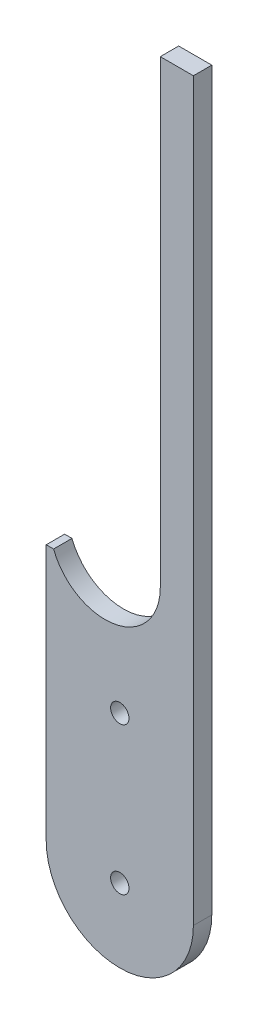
ISO-10303-21;
HEADER;
FILE_DESCRIPTION(('STEP AP214'),'2;1');
FILE_NAME('part.step','',(''),(''),'','','');
FILE_SCHEMA(('AUTOMOTIVE_DESIGN { 1 0 10303 214 1 1 1 1 }'));
ENDSEC;
DATA;
#1=APPLICATION_CONTEXT('core data for automotive mechanical design processes');
#2=APPLICATION_PROTOCOL_DEFINITION('international standard','automotive_design',2000,#1);
#3=PRODUCT_CONTEXT('',#1,'mechanical');
#4=PRODUCT('Part','Part','',(#3));
#5=PRODUCT_RELATED_PRODUCT_CATEGORY('part','',(#4));
#6=PRODUCT_DEFINITION_FORMATION('','',#4);
#7=PRODUCT_DEFINITION_CONTEXT('part definition',#1,'design');
#8=PRODUCT_DEFINITION('design','',#6,#7);
#9=PRODUCT_DEFINITION_SHAPE('','',#8);
#10=(LENGTH_UNIT() NAMED_UNIT(*) SI_UNIT(.MILLI.,.METRE.));
#11=(NAMED_UNIT(*) PLANE_ANGLE_UNIT() SI_UNIT($,.RADIAN.));
#12=(NAMED_UNIT(*) SI_UNIT($,.STERADIAN.) SOLID_ANGLE_UNIT());
#13=UNCERTAINTY_MEASURE_WITH_UNIT(LENGTH_MEASURE(1.E-05),#10,'distance_accuracy_value','');
#14=(GEOMETRIC_REPRESENTATION_CONTEXT(3) GLOBAL_UNCERTAINTY_ASSIGNED_CONTEXT((#13)) GLOBAL_UNIT_ASSIGNED_CONTEXT((#10,
#11,#12)) REPRESENTATION_CONTEXT('',''));
#15=CARTESIAN_POINT('',(0.,0.,0.));
#16=DIRECTION('',(0.,0.,1.));
#17=DIRECTION('',(1.,0.,0.));
#18=AXIS2_PLACEMENT_3D('',#15,#16,#17);
#19=CARTESIAN_POINT('',(-25.4,0.,3.175));
#20=DIRECTION('',(-1.,0.,0.));
#21=DIRECTION('',(0.,0.,1.));
#22=AXIS2_PLACEMENT_3D('',#19,#20,#21);
#23=PLANE('',#22);
#24=DIRECTION('',(0.,1.,0.));
#25=VECTOR('',#24,1.);
#26=CARTESIAN_POINT('',(-25.4,0.,0.));
#27=LINE('',#26,#25);
#28=CARTESIAN_POINT('',(-25.4,12.7,0.));
#29=VERTEX_POINT('',#28);
#30=CARTESIAN_POINT('',(-25.4,56.9054203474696,0.));
#31=VERTEX_POINT('',#30);
#32=EDGE_CURVE('E134',#29,#31,#27,.T.);
#33=ORIENTED_EDGE('',*,*,#32,.F.);
#34=DIRECTION('',(0.,0.,-1.));
#35=VECTOR('',#34,1.);
#36=CARTESIAN_POINT('',(-25.4,12.7,3.175));
#37=LINE('',#36,#35);
#38=CARTESIAN_POINT('',(-25.4,12.7,3.175));
#39=VERTEX_POINT('',#38);
#40=EDGE_CURVE('E11',#29,#39,#37,.F.);
#41=ORIENTED_EDGE('',*,*,#40,.T.);
#42=DIRECTION('',(0.,1.,0.));
#43=VECTOR('',#42,1.);
#44=CARTESIAN_POINT('',(-25.4,0.,3.175));
#45=LINE('',#44,#43);
#46=CARTESIAN_POINT('',(-25.4,56.9054203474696,3.175));
#47=VERTEX_POINT('',#46);
#48=EDGE_CURVE('E108',#39,#47,#45,.T.);
#49=ORIENTED_EDGE('',*,*,#48,.T.);
#50=DIRECTION('',(0.,0.,-1.));
#51=VECTOR('',#50,1.);
#52=CARTESIAN_POINT('',(-25.4,56.9054203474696,3.175));
#53=LINE('',#52,#51);
#54=EDGE_CURVE('E133',#47,#31,#53,.T.);
#55=ORIENTED_EDGE('',*,*,#54,.T.);
#56=EDGE_LOOP('',(#33,#41,#49,#55));
#57=FACE_BOUND('',#56,.T.);
#58=ADVANCED_FACE('F33',(#57),#23,.T.);
#59=CARTESIAN_POINT('',(0.,0.,3.175));
#60=DIRECTION('',(-1.,0.,0.));
#61=DIRECTION('',(0.,0.,1.));
#62=AXIS2_PLACEMENT_3D('',#59,#60,#61);
#63=PLANE('',#62);
#64=DIRECTION('',(0.,1.,0.));
#65=VECTOR('',#64,1.);
#66=CARTESIAN_POINT('',(0.,0.,3.175));
#67=LINE('',#66,#65);
#68=CARTESIAN_POINT('',(0.,12.7,3.175));
#69=VERTEX_POINT('',#68);
#70=CARTESIAN_POINT('',(0.,139.7,3.175));
#71=VERTEX_POINT('',#70);
#72=EDGE_CURVE('E97',#69,#71,#67,.T.);
#73=ORIENTED_EDGE('',*,*,#72,.F.);
#74=DIRECTION('',(0.,0.,-1.));
#75=VECTOR('',#74,1.);
#76=CARTESIAN_POINT('',(0.,12.7,0.));
#77=LINE('',#76,#75);
#78=CARTESIAN_POINT('',(0.,12.7,0.));
#79=VERTEX_POINT('',#78);
#80=EDGE_CURVE('E118',#69,#79,#77,.T.);
#81=ORIENTED_EDGE('',*,*,#80,.T.);
#82=DIRECTION('',(0.,1.,0.));
#83=VECTOR('',#82,1.);
#84=CARTESIAN_POINT('',(0.,0.,0.));
#85=LINE('',#84,#83);
#86=CARTESIAN_POINT('',(0.,139.7,0.));
#87=VERTEX_POINT('',#86);
#88=EDGE_CURVE('E114',#79,#87,#85,.T.);
#89=ORIENTED_EDGE('',*,*,#88,.T.);
#90=DIRECTION('',(0.,0.,-1.));
#91=VECTOR('',#90,1.);
#92=CARTESIAN_POINT('',(0.,139.7,3.175));
#93=LINE('',#92,#91);
#94=EDGE_CURVE('E111',#71,#87,#93,.T.);
#95=ORIENTED_EDGE('',*,*,#94,.F.);
#96=EDGE_LOOP('',(#73,#81,#89,#95));
#97=FACE_BOUND('',#96,.T.);
#98=ADVANCED_FACE('F112',(#97),#63,.F.);
#99=CARTESIAN_POINT('',(0.,139.7,3.175));
#100=DIRECTION('',(0.,1.,0.));
#101=DIRECTION('',(0.,0.,1.));
#102=AXIS2_PLACEMENT_3D('',#99,#100,#101);
#103=PLANE('',#102);
#104=DIRECTION('',(1.,0.,0.));
#105=VECTOR('',#104,1.);
#106=CARTESIAN_POINT('',(0.,139.7,0.));
#107=LINE('',#106,#105);
#108=CARTESIAN_POINT('',(-5.71500000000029,139.7,0.));
#109=VERTEX_POINT('',#108);
#110=EDGE_CURVE('E138',#109,#87,#107,.T.);
#111=ORIENTED_EDGE('',*,*,#110,.F.);
#112=DIRECTION('',(0.,0.,-1.));
#113=VECTOR('',#112,1.);
#114=CARTESIAN_POINT('',(-5.71500000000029,139.7,3.175));
#115=LINE('',#114,#113);
#116=CARTESIAN_POINT('',(-5.71500000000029,139.7,3.175));
#117=VERTEX_POINT('',#116);
#118=EDGE_CURVE('E119',#117,#109,#115,.T.);
#119=ORIENTED_EDGE('',*,*,#118,.F.);
#120=DIRECTION('',(1.,0.,0.));
#121=VECTOR('',#120,1.);
#122=CARTESIAN_POINT('',(0.,139.7,3.175));
#123=LINE('',#122,#121);
#124=EDGE_CURVE('E102',#117,#71,#123,.T.);
#125=ORIENTED_EDGE('',*,*,#124,.T.);
#126=ORIENTED_EDGE('',*,*,#94,.T.);
#127=EDGE_LOOP('',(#111,#119,#125,#126));
#128=FACE_BOUND('',#127,.T.);
#129=ADVANCED_FACE('F121',(#128),#103,.T.);
#130=CARTESIAN_POINT('',(-5.71499999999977,0.,3.175));
#131=DIRECTION('',(-1.,0.,0.));
#132=DIRECTION('',(0.,-1.,0.));
#133=AXIS2_PLACEMENT_3D('',#130,#131,#132);
#134=PLANE('',#133);
#135=DIRECTION('',(0.,1.,0.));
#136=VECTOR('',#135,1.);
#137=CARTESIAN_POINT('',(-5.71499999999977,0.,0.));
#138=LINE('',#137,#136);
#139=CARTESIAN_POINT('',(-5.71499999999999,60.325,0.));
#140=VERTEX_POINT('',#139);
#141=EDGE_CURVE('E140',#140,#109,#138,.T.);
#142=ORIENTED_EDGE('',*,*,#141,.F.);
#143=DIRECTION('',(0.,0.,-1.));
#144=VECTOR('',#143,1.);
#145=CARTESIAN_POINT('',(-5.71499999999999,60.325,3.175));
#146=LINE('',#145,#144);
#147=CARTESIAN_POINT('',(-5.71499999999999,60.325,3.175));
#148=VERTEX_POINT('',#147);
#149=EDGE_CURVE('E153',#148,#140,#146,.T.);
#150=ORIENTED_EDGE('',*,*,#149,.F.);
#151=DIRECTION('',(0.,1.,0.));
#152=VECTOR('',#151,1.);
#153=CARTESIAN_POINT('',(-5.71499999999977,0.,3.175));
#154=LINE('',#153,#152);
#155=EDGE_CURVE('E122',#148,#117,#154,.T.);
#156=ORIENTED_EDGE('',*,*,#155,.T.);
#157=ORIENTED_EDGE('',*,*,#118,.T.);
#158=EDGE_LOOP('',(#142,#150,#156,#157));
#159=FACE_BOUND('',#158,.T.);
#160=ADVANCED_FACE('F190',(#159),#134,.T.);
#161=CARTESIAN_POINT('',(-15.24,60.325,3.175));
#162=DIRECTION('',(0.,0.,-1.));
#163=DIRECTION('',(-1.,0.,0.));
#164=AXIS2_PLACEMENT_3D('',#161,#162,#163);
#165=CYLINDRICAL_SURFACE('',#164,9.525);
#166=CARTESIAN_POINT('',(-15.24,60.325,0.));
#167=DIRECTION('',(0.,0.,1.));
#168=DIRECTION('',(1.,0.,0.));
#169=AXIS2_PLACEMENT_3D('',#166,#167,#168);
#170=CIRCLE('',#169,9.525);
#171=CARTESIAN_POINT('',(-24.13,56.9054203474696,0.));
#172=VERTEX_POINT('',#171);
#173=EDGE_CURVE('E143',#172,#140,#170,.T.);
#174=ORIENTED_EDGE('',*,*,#173,.F.);
#175=DIRECTION('',(0.,0.,-1.));
#176=VECTOR('',#175,1.);
#177=CARTESIAN_POINT('',(-24.13,56.9054203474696,3.175));
#178=LINE('',#177,#176);
#179=CARTESIAN_POINT('',(-24.13,56.9054203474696,3.175));
#180=VERTEX_POINT('',#179);
#181=EDGE_CURVE('E151',#180,#172,#178,.T.);
#182=ORIENTED_EDGE('',*,*,#181,.F.);
#183=CARTESIAN_POINT('',(-15.24,60.325,3.175));
#184=DIRECTION('',(0.,0.,1.));
#185=DIRECTION('',(1.,0.,0.));
#186=AXIS2_PLACEMENT_3D('',#183,#184,#185);
#187=CIRCLE('',#186,9.525);
#188=EDGE_CURVE('E124',#180,#148,#187,.T.);
#189=ORIENTED_EDGE('',*,*,#188,.T.);
#190=ORIENTED_EDGE('',*,*,#149,.T.);
#191=EDGE_LOOP('',(#174,#182,#189,#190));
#192=FACE_BOUND('',#191,.T.);
#193=ADVANCED_FACE('F187',(#192),#165,.F.);
#194=CARTESIAN_POINT('',(0.,56.9054203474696,3.175));
#195=DIRECTION('',(0.,-1.,0.));
#196=DIRECTION('',(0.,0.,-1.));
#197=AXIS2_PLACEMENT_3D('',#194,#195,#196);
#198=PLANE('',#197);
#199=DIRECTION('',(-1.,0.,0.));
#200=VECTOR('',#199,1.);
#201=CARTESIAN_POINT('',(0.,56.9054203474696,0.));
#202=LINE('',#201,#200);
#203=EDGE_CURVE('E146',#172,#31,#202,.T.);
#204=ORIENTED_EDGE('',*,*,#203,.T.);
#205=ORIENTED_EDGE('',*,*,#54,.F.);
#206=DIRECTION('',(-1.,0.,0.));
#207=VECTOR('',#206,1.);
#208=CARTESIAN_POINT('',(0.,56.9054203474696,3.175));
#209=LINE('',#208,#207);
#210=EDGE_CURVE('E130',#180,#47,#209,.T.);
#211=ORIENTED_EDGE('',*,*,#210,.F.);
#212=ORIENTED_EDGE('',*,*,#181,.T.);
#213=EDGE_LOOP('',(#204,#205,#211,#212));
#214=FACE_BOUND('',#213,.T.);
#215=ADVANCED_FACE('F183',(#214),#198,.F.);
#216=CARTESIAN_POINT('',(0.,0.,3.175));
#217=DIRECTION('',(0.,0.,1.));
#218=DIRECTION('',(1.,0.,0.));
#219=AXIS2_PLACEMENT_3D('',#216,#217,#218);
#220=PLANE('',#219);
#221=CARTESIAN_POINT('',(-12.7,38.1,3.175));
#222=DIRECTION('',(0.,0.,1.));
#223=DIRECTION('',(1.,0.,0.));
#224=AXIS2_PLACEMENT_3D('',#221,#222,#223);
#225=CIRCLE('',#224,1.5875);
#226=CARTESIAN_POINT('',(-11.1125,38.1,3.175));
#227=VERTEX_POINT('',#226);
#228=EDGE_CURVE('E176',#227,#227,#225,.T.);
#229=ORIENTED_EDGE('',*,*,#228,.F.);
#230=EDGE_LOOP('',(#229));
#231=FACE_BOUND('',#230,.T.);
#232=CARTESIAN_POINT('',(-12.7,12.7,3.175));
#233=DIRECTION('',(0.,0.,1.));
#234=DIRECTION('',(1.,0.,0.));
#235=AXIS2_PLACEMENT_3D('',#232,#233,#234);
#236=CIRCLE('',#235,1.5875);
#237=CARTESIAN_POINT('',(-11.1125,12.7,3.175));
#238=VERTEX_POINT('',#237);
#239=EDGE_CURVE('E169',#238,#238,#236,.T.);
#240=ORIENTED_EDGE('',*,*,#239,.F.);
#241=EDGE_LOOP('',(#240));
#242=FACE_BOUND('',#241,.T.);
#243=CARTESIAN_POINT('',(-12.7,12.7,3.175));
#244=DIRECTION('',(0.,0.,1.));
#245=DIRECTION('',(1.,0.,0.));
#246=AXIS2_PLACEMENT_3D('',#243,#244,#245);
#247=CIRCLE('',#246,12.7);
#248=CARTESIAN_POINT('',(-12.7,0.,3.175));
#249=VERTEX_POINT('',#248);
#250=EDGE_CURVE('E49',#39,#249,#247,.T.);
#251=ORIENTED_EDGE('',*,*,#250,.T.);
#252=CARTESIAN_POINT('',(-12.7,12.7,3.175));
#253=DIRECTION('',(0.,0.,1.));
#254=DIRECTION('',(1.,0.,0.));
#255=AXIS2_PLACEMENT_3D('',#252,#253,#254);
#256=CIRCLE('',#255,12.7);
#257=EDGE_CURVE('E42',#249,#69,#256,.T.);
#258=ORIENTED_EDGE('',*,*,#257,.T.);
#259=ORIENTED_EDGE('',*,*,#72,.T.);
#260=ORIENTED_EDGE('',*,*,#124,.F.);
#261=ORIENTED_EDGE('',*,*,#155,.F.);
#262=ORIENTED_EDGE('',*,*,#188,.F.);
#263=ORIENTED_EDGE('',*,*,#210,.T.);
#264=ORIENTED_EDGE('',*,*,#48,.F.);
#265=EDGE_LOOP('',(#251,#258,#259,#260,#261,#262,#263,#264));
#266=FACE_BOUND('',#265,.T.);
#267=ADVANCED_FACE('F99',(#231,#242,#266),#220,.T.);
#268=CARTESIAN_POINT('',(0.,0.,0.));
#269=DIRECTION('',(0.,0.,1.));
#270=DIRECTION('',(1.,0.,0.));
#271=AXIS2_PLACEMENT_3D('',#268,#269,#270);
#272=PLANE('',#271);
#273=CARTESIAN_POINT('',(-12.7,38.1,0.));
#274=DIRECTION('',(0.,0.,1.));
#275=DIRECTION('',(1.,0.,0.));
#276=AXIS2_PLACEMENT_3D('',#273,#274,#275);
#277=CIRCLE('',#276,1.5875);
#278=CARTESIAN_POINT('',(-11.1125,38.1,0.));
#279=VERTEX_POINT('',#278);
#280=EDGE_CURVE('E136',#279,#279,#277,.T.);
#281=ORIENTED_EDGE('',*,*,#280,.T.);
#282=EDGE_LOOP('',(#281));
#283=FACE_BOUND('',#282,.T.);
#284=CARTESIAN_POINT('',(-12.7,12.7,0.));
#285=DIRECTION('',(0.,0.,1.));
#286=DIRECTION('',(1.,0.,0.));
#287=AXIS2_PLACEMENT_3D('',#284,#285,#286);
#288=CIRCLE('',#287,1.5875);
#289=CARTESIAN_POINT('',(-11.1125,12.7,0.));
#290=VERTEX_POINT('',#289);
#291=EDGE_CURVE('E171',#290,#290,#288,.T.);
#292=ORIENTED_EDGE('',*,*,#291,.T.);
#293=EDGE_LOOP('',(#292));
#294=FACE_BOUND('',#293,.T.);
#295=ORIENTED_EDGE('',*,*,#88,.F.);
#296=CARTESIAN_POINT('',(-12.7,12.7,0.));
#297=DIRECTION('',(0.,0.,1.));
#298=DIRECTION('',(1.,0.,0.));
#299=AXIS2_PLACEMENT_3D('',#296,#297,#298);
#300=CIRCLE('',#299,12.7);
#301=CARTESIAN_POINT('',(-12.7,0.,0.));
#302=VERTEX_POINT('',#301);
#303=EDGE_CURVE('E159',#79,#302,#300,.F.);
#304=ORIENTED_EDGE('',*,*,#303,.T.);
#305=CARTESIAN_POINT('',(-12.7,12.7,0.));
#306=DIRECTION('',(0.,0.,1.));
#307=DIRECTION('',(1.,0.,0.));
#308=AXIS2_PLACEMENT_3D('',#305,#306,#307);
#309=CIRCLE('',#308,12.7);
#310=EDGE_CURVE('E157',#302,#29,#309,.F.);
#311=ORIENTED_EDGE('',*,*,#310,.T.);
#312=ORIENTED_EDGE('',*,*,#32,.T.);
#313=ORIENTED_EDGE('',*,*,#203,.F.);
#314=ORIENTED_EDGE('',*,*,#173,.T.);
#315=ORIENTED_EDGE('',*,*,#141,.T.);
#316=ORIENTED_EDGE('',*,*,#110,.T.);
#317=EDGE_LOOP('',(#295,#304,#311,#312,#313,#314,#315,#316));
#318=FACE_BOUND('',#317,.T.);
#319=ADVANCED_FACE('F164',(#283,#294,#318),#272,.F.);
#320=CARTESIAN_POINT('',(-12.7,12.7,0.));
#321=DIRECTION('',(0.,0.,1.));
#322=DIRECTION('',(1.,0.,0.));
#323=AXIS2_PLACEMENT_3D('',#320,#321,#322);
#324=CYLINDRICAL_SURFACE('',#323,1.5875);
#325=ORIENTED_EDGE('',*,*,#291,.F.);
#326=EDGE_LOOP('',(#325));
#327=FACE_BOUND('',#326,.T.);
#328=ORIENTED_EDGE('',*,*,#239,.T.);
#329=EDGE_LOOP('',(#328));
#330=FACE_BOUND('',#329,.T.);
#331=ADVANCED_FACE('F213',(#327,#330),#324,.F.);
#332=CARTESIAN_POINT('',(-12.7,38.1,0.));
#333=DIRECTION('',(0.,0.,1.));
#334=DIRECTION('',(1.,0.,0.));
#335=AXIS2_PLACEMENT_3D('',#332,#333,#334);
#336=CYLINDRICAL_SURFACE('',#335,1.5875);
#337=ORIENTED_EDGE('',*,*,#280,.F.);
#338=EDGE_LOOP('',(#337));
#339=FACE_BOUND('',#338,.T.);
#340=ORIENTED_EDGE('',*,*,#228,.T.);
#341=EDGE_LOOP('',(#340));
#342=FACE_BOUND('',#341,.T.);
#343=ADVANCED_FACE('F209',(#339,#342),#336,.F.);
#344=CARTESIAN_POINT('',(-12.7,12.7,3.175));
#345=DIRECTION('',(0.,0.,-1.));
#346=DIRECTION('',(-1.,0.,0.));
#347=AXIS2_PLACEMENT_3D('',#344,#345,#346);
#348=CYLINDRICAL_SURFACE('',#347,12.7);
#349=DIRECTION('',(0.,0.,-1.));
#350=VECTOR('',#349,1.);
#351=CARTESIAN_POINT('',(-12.7,0.,3.175));
#352=LINE('',#351,#350);
#353=EDGE_CURVE('E37',#249,#302,#352,.T.);
#354=ORIENTED_EDGE('',*,*,#353,.F.);
#355=ORIENTED_EDGE('',*,*,#250,.F.);
#356=ORIENTED_EDGE('',*,*,#40,.F.);
#357=ORIENTED_EDGE('',*,*,#310,.F.);
#358=EDGE_LOOP('',(#354,#355,#356,#357));
#359=FACE_BOUND('',#358,.T.);
#360=ADVANCED_FACE('F35',(#359),#348,.T.);
#361=CARTESIAN_POINT('',(-12.7,12.7,3.175));
#362=DIRECTION('',(0.,0.,1.));
#363=DIRECTION('',(1.,0.,0.));
#364=AXIS2_PLACEMENT_3D('',#361,#362,#363);
#365=CYLINDRICAL_SURFACE('',#364,12.7);
#366=ORIENTED_EDGE('',*,*,#257,.F.);
#367=ORIENTED_EDGE('',*,*,#353,.T.);
#368=ORIENTED_EDGE('',*,*,#303,.F.);
#369=ORIENTED_EDGE('',*,*,#80,.F.);
#370=EDGE_LOOP('',(#366,#367,#368,#369));
#371=FACE_BOUND('',#370,.T.);
#372=ADVANCED_FACE('F168',(#371),#365,.T.);
#373=CLOSED_SHELL('',(#58,#98,#129,#160,#193,#215,#267,#319,#331,#343,#360,#372));
#374=MANIFOLD_SOLID_BREP('B2',#373);
#375=ADVANCED_BREP_SHAPE_REPRESENTATION('',(#18,#374),#14);
#376=SHAPE_DEFINITION_REPRESENTATION(#9,#375);
ENDSEC;
END-ISO-10303-21;
